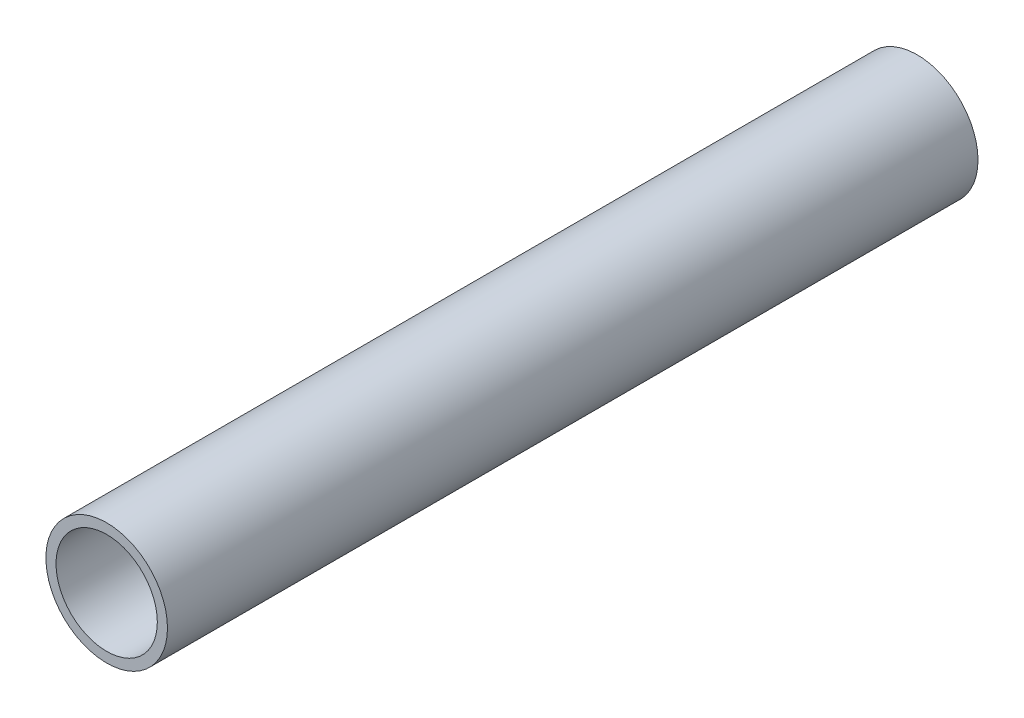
ISO-10303-21;
HEADER;
FILE_DESCRIPTION(('STEP AP214'),'2;1');
FILE_NAME('part.step','',(''),(''),'','','');
FILE_SCHEMA(('AUTOMOTIVE_DESIGN { 1 0 10303 214 1 1 1 1 }'));
ENDSEC;
DATA;
#1=APPLICATION_CONTEXT('core data for automotive mechanical design processes');
#2=APPLICATION_PROTOCOL_DEFINITION('international standard','automotive_design',2000,#1);
#3=PRODUCT_CONTEXT('',#1,'mechanical');
#4=PRODUCT('Part','Part','',(#3));
#5=PRODUCT_RELATED_PRODUCT_CATEGORY('part','',(#4));
#6=PRODUCT_DEFINITION_FORMATION('','',#4);
#7=PRODUCT_DEFINITION_CONTEXT('part definition',#1,'design');
#8=PRODUCT_DEFINITION('design','',#6,#7);
#9=PRODUCT_DEFINITION_SHAPE('','',#8);
#10=(LENGTH_UNIT() NAMED_UNIT(*) SI_UNIT(.MILLI.,.METRE.));
#11=(NAMED_UNIT(*) PLANE_ANGLE_UNIT() SI_UNIT($,.RADIAN.));
#12=(NAMED_UNIT(*) SI_UNIT($,.STERADIAN.) SOLID_ANGLE_UNIT());
#13=UNCERTAINTY_MEASURE_WITH_UNIT(LENGTH_MEASURE(1.E-05),#10,'distance_accuracy_value','');
#14=(GEOMETRIC_REPRESENTATION_CONTEXT(3) GLOBAL_UNCERTAINTY_ASSIGNED_CONTEXT((#13)) GLOBAL_UNIT_ASSIGNED_CONTEXT((#10,
#11,#12)) REPRESENTATION_CONTEXT('',''));
#15=CARTESIAN_POINT('',(0.,0.,0.));
#16=DIRECTION('',(0.,0.,1.));
#17=DIRECTION('',(1.,0.,0.));
#18=AXIS2_PLACEMENT_3D('',#15,#16,#17);
#19=CARTESIAN_POINT('',(0.,0.,40.));
#20=DIRECTION('',(0.,0.,1.));
#21=DIRECTION('',(1.,0.,0.));
#22=AXIS2_PLACEMENT_3D('',#19,#20,#21);
#23=PLANE('',#22);
#24=CARTESIAN_POINT('',(0.,0.,40.));
#25=DIRECTION('',(0.,0.,1.));
#26=DIRECTION('',(1.,0.,0.));
#27=AXIS2_PLACEMENT_3D('',#24,#25,#26);
#28=CIRCLE('',#27,6.);
#29=CARTESIAN_POINT('',(6.,0.,40.));
#30=VERTEX_POINT('',#29);
#31=EDGE_CURVE('E10',#30,#30,#28,.T.);
#32=ORIENTED_EDGE('',*,*,#31,.T.);
#33=EDGE_LOOP('',(#32));
#34=FACE_BOUND('',#33,.T.);
#35=CARTESIAN_POINT('',(0.,0.,40.));
#36=DIRECTION('',(0.,0.,1.));
#37=DIRECTION('',(1.,0.,0.));
#38=AXIS2_PLACEMENT_3D('',#35,#36,#37);
#39=CIRCLE('',#38,5.);
#40=CARTESIAN_POINT('',(5.,0.,40.));
#41=VERTEX_POINT('',#40);
#42=EDGE_CURVE('E52',#41,#41,#39,.T.);
#43=ORIENTED_EDGE('',*,*,#42,.F.);
#44=EDGE_LOOP('',(#43));
#45=FACE_BOUND('',#44,.T.);
#46=ADVANCED_FACE('F38',(#34,#45),#23,.T.);
#47=CARTESIAN_POINT('',(0.,0.,-40.));
#48=DIRECTION('',(0.,0.,1.));
#49=DIRECTION('',(1.,0.,0.));
#50=AXIS2_PLACEMENT_3D('',#47,#48,#49);
#51=PLANE('',#50);
#52=CARTESIAN_POINT('',(0.,0.,-40.));
#53=DIRECTION('',(0.,0.,1.));
#54=DIRECTION('',(1.,0.,0.));
#55=AXIS2_PLACEMENT_3D('',#52,#53,#54);
#56=CIRCLE('',#55,6.);
#57=CARTESIAN_POINT('',(6.,0.,-40.));
#58=VERTEX_POINT('',#57);
#59=EDGE_CURVE('E42',#58,#58,#56,.T.);
#60=ORIENTED_EDGE('',*,*,#59,.F.);
#61=EDGE_LOOP('',(#60));
#62=FACE_BOUND('',#61,.T.);
#63=CARTESIAN_POINT('',(0.,0.,-40.));
#64=DIRECTION('',(0.,0.,1.));
#65=DIRECTION('',(1.,0.,0.));
#66=AXIS2_PLACEMENT_3D('',#63,#64,#65);
#67=CIRCLE('',#66,5.);
#68=CARTESIAN_POINT('',(5.,0.,-40.));
#69=VERTEX_POINT('',#68);
#70=EDGE_CURVE('E54',#69,#69,#67,.T.);
#71=ORIENTED_EDGE('',*,*,#70,.T.);
#72=EDGE_LOOP('',(#71));
#73=FACE_BOUND('',#72,.T.);
#74=ADVANCED_FACE('F65',(#62,#73),#51,.F.);
#75=CARTESIAN_POINT('',(0.,0.,40.));
#76=DIRECTION('',(0.,0.,-1.));
#77=DIRECTION('',(-1.,0.,0.));
#78=AXIS2_PLACEMENT_3D('',#75,#76,#77);
#79=CYLINDRICAL_SURFACE('',#78,6.);
#80=ORIENTED_EDGE('',*,*,#31,.F.);
#81=EDGE_LOOP('',(#80));
#82=FACE_BOUND('',#81,.T.);
#83=ORIENTED_EDGE('',*,*,#59,.T.);
#84=EDGE_LOOP('',(#83));
#85=FACE_BOUND('',#84,.T.);
#86=ADVANCED_FACE('F40',(#82,#85),#79,.T.);
#87=CARTESIAN_POINT('',(0.,0.,40.));
#88=DIRECTION('',(0.,0.,-1.));
#89=DIRECTION('',(-1.,0.,0.));
#90=AXIS2_PLACEMENT_3D('',#87,#88,#89);
#91=CYLINDRICAL_SURFACE('',#90,5.);
#92=ORIENTED_EDGE('',*,*,#42,.T.);
#93=EDGE_LOOP('',(#92));
#94=FACE_BOUND('',#93,.T.);
#95=ORIENTED_EDGE('',*,*,#70,.F.);
#96=EDGE_LOOP('',(#95));
#97=FACE_BOUND('',#96,.T.);
#98=ADVANCED_FACE('F61',(#94,#97),#91,.F.);
#99=CLOSED_SHELL('',(#46,#74,#86,#98));
#100=MANIFOLD_SOLID_BREP('B2',#99);
#101=ADVANCED_BREP_SHAPE_REPRESENTATION('',(#18,#100),#14);
#102=SHAPE_DEFINITION_REPRESENTATION(#9,#101);
ENDSEC;
END-ISO-10303-21;
